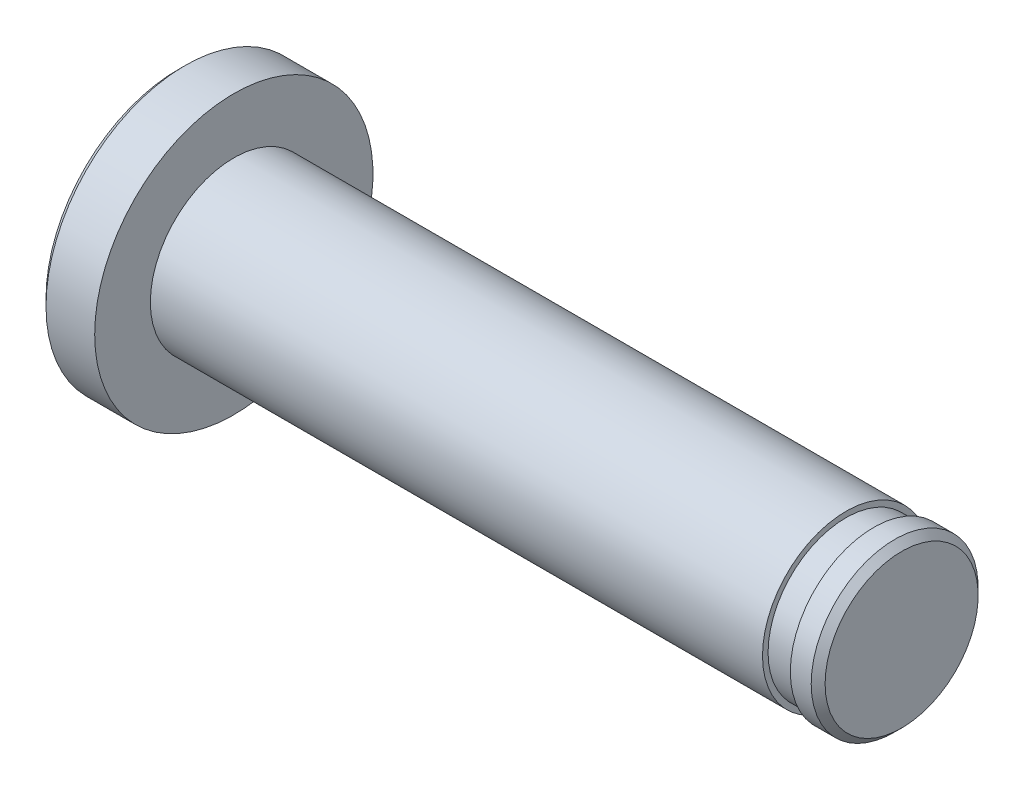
ISO-10303-21;
HEADER;
FILE_DESCRIPTION(('STEP AP214'),'2;1');
FILE_NAME('part.step','',(''),(''),'','','');
FILE_SCHEMA(('AUTOMOTIVE_DESIGN { 1 0 10303 214 1 1 1 1 }'));
ENDSEC;
DATA;
#1=APPLICATION_CONTEXT('core data for automotive mechanical design processes');
#2=APPLICATION_PROTOCOL_DEFINITION('international standard','automotive_design',2000,#1);
#3=PRODUCT_CONTEXT('',#1,'mechanical');
#4=PRODUCT('Part','Part','',(#3));
#5=PRODUCT_RELATED_PRODUCT_CATEGORY('part','',(#4));
#6=PRODUCT_DEFINITION_FORMATION('','',#4);
#7=PRODUCT_DEFINITION_CONTEXT('part definition',#1,'design');
#8=PRODUCT_DEFINITION('design','',#6,#7);
#9=PRODUCT_DEFINITION_SHAPE('','',#8);
#10=(LENGTH_UNIT() NAMED_UNIT(*) SI_UNIT(.MILLI.,.METRE.));
#11=(NAMED_UNIT(*) PLANE_ANGLE_UNIT() SI_UNIT($,.RADIAN.));
#12=(NAMED_UNIT(*) SI_UNIT($,.STERADIAN.) SOLID_ANGLE_UNIT());
#13=UNCERTAINTY_MEASURE_WITH_UNIT(LENGTH_MEASURE(1.E-05),#10,'distance_accuracy_value','');
#14=(GEOMETRIC_REPRESENTATION_CONTEXT(3) GLOBAL_UNCERTAINTY_ASSIGNED_CONTEXT((#13)) GLOBAL_UNIT_ASSIGNED_CONTEXT((#10,
#11,#12)) REPRESENTATION_CONTEXT('',''));
#15=CARTESIAN_POINT('',(0.,0.,0.));
#16=DIRECTION('',(0.,0.,1.));
#17=DIRECTION('',(1.,0.,0.));
#18=AXIS2_PLACEMENT_3D('',#15,#16,#17);
#19=CARTESIAN_POINT('',(24.,2.75,0.));
#20=DIRECTION('',(-1.,0.,0.));
#21=DIRECTION('',(0.,0.,1.));
#22=AXIS2_PLACEMENT_3D('',#19,#20,#21);
#23=PLANE('',#22);
#24=CARTESIAN_POINT('',(24.,0.,0.));
#25=DIRECTION('',(-1.,0.,0.));
#26=DIRECTION('',(0.,0.,1.));
#27=AXIS2_PLACEMENT_3D('',#24,#25,#26);
#28=CIRCLE('',#27,2.75);
#29=CARTESIAN_POINT('',(24.,0.,2.75));
#30=VERTEX_POINT('',#29);
#31=EDGE_CURVE('E10',#30,#30,#28,.T.);
#32=ORIENTED_EDGE('',*,*,#31,.F.);
#33=EDGE_LOOP('',(#32));
#34=FACE_BOUND('',#33,.T.);
#35=ADVANCED_FACE('F31',(#34),#23,.F.);
#36=CARTESIAN_POINT('',(24.,0.,0.));
#37=DIRECTION('',(-1.,0.,0.));
#38=DIRECTION('',(0.,0.,1.));
#39=AXIS2_PLACEMENT_3D('',#36,#37,#38);
#40=CONICAL_SURFACE('',#39,2.75,0.785398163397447);
#41=CARTESIAN_POINT('',(23.75,0.,0.));
#42=DIRECTION('',(-1.,0.,0.));
#43=DIRECTION('',(0.,0.,1.));
#44=AXIS2_PLACEMENT_3D('',#41,#42,#43);
#45=CIRCLE('',#44,3.);
#46=CARTESIAN_POINT('',(23.75,0.,3.));
#47=VERTEX_POINT('',#46);
#48=EDGE_CURVE('E37',#47,#47,#45,.T.);
#49=ORIENTED_EDGE('',*,*,#48,.F.);
#50=EDGE_LOOP('',(#49));
#51=FACE_BOUND('',#50,.T.);
#52=ORIENTED_EDGE('',*,*,#31,.T.);
#53=EDGE_LOOP('',(#52));
#54=FACE_BOUND('',#53,.T.);
#55=ADVANCED_FACE('F115',(#51,#54),#40,.T.);
#56=CARTESIAN_POINT('',(0.,0.,0.));
#57=DIRECTION('',(-1.,0.,0.));
#58=DIRECTION('',(0.,0.,1.));
#59=AXIS2_PLACEMENT_3D('',#56,#57,#58);
#60=CYLINDRICAL_SURFACE('',#59,3.);
#61=CARTESIAN_POINT('',(23.,0.,0.));
#62=DIRECTION('',(-1.,0.,0.));
#63=DIRECTION('',(0.,0.,1.));
#64=AXIS2_PLACEMENT_3D('',#61,#62,#63);
#65=CIRCLE('',#64,3.);
#66=CARTESIAN_POINT('',(23.,0.,3.));
#67=VERTEX_POINT('',#66);
#68=EDGE_CURVE('E41',#67,#67,#65,.T.);
#69=ORIENTED_EDGE('',*,*,#68,.F.);
#70=EDGE_LOOP('',(#69));
#71=FACE_BOUND('',#70,.T.);
#72=ORIENTED_EDGE('',*,*,#48,.T.);
#73=EDGE_LOOP('',(#72));
#74=FACE_BOUND('',#73,.T.);
#75=ADVANCED_FACE('F110',(#71,#74),#60,.T.);
#76=CARTESIAN_POINT('',(23.,2.8,0.));
#77=DIRECTION('',(1.,0.,0.));
#78=DIRECTION('',(0.,0.,-1.));
#79=AXIS2_PLACEMENT_3D('',#76,#77,#78);
#80=PLANE('',#79);
#81=CARTESIAN_POINT('',(23.,0.,0.));
#82=DIRECTION('',(-1.,0.,0.));
#83=DIRECTION('',(0.,0.,1.));
#84=AXIS2_PLACEMENT_3D('',#81,#82,#83);
#85=CIRCLE('',#84,2.8);
#86=CARTESIAN_POINT('',(23.,0.,2.8));
#87=VERTEX_POINT('',#86);
#88=EDGE_CURVE('E45',#87,#87,#85,.T.);
#89=ORIENTED_EDGE('',*,*,#88,.F.);
#90=EDGE_LOOP('',(#89));
#91=FACE_BOUND('',#90,.T.);
#92=ORIENTED_EDGE('',*,*,#68,.T.);
#93=EDGE_LOOP('',(#92));
#94=FACE_BOUND('',#93,.T.);
#95=ADVANCED_FACE('F104',(#91,#94),#80,.F.);
#96=CARTESIAN_POINT('',(0.,0.,0.));
#97=DIRECTION('',(-1.,0.,0.));
#98=DIRECTION('',(0.,0.,1.));
#99=AXIS2_PLACEMENT_3D('',#96,#97,#98);
#100=CYLINDRICAL_SURFACE('',#99,2.8);
#101=CARTESIAN_POINT('',(22.,0.,0.));
#102=DIRECTION('',(-1.,0.,0.));
#103=DIRECTION('',(0.,0.,1.));
#104=AXIS2_PLACEMENT_3D('',#101,#102,#103);
#105=CIRCLE('',#104,2.8);
#106=CARTESIAN_POINT('',(22.,0.,2.8));
#107=VERTEX_POINT('',#106);
#108=EDGE_CURVE('E50',#107,#107,#105,.T.);
#109=ORIENTED_EDGE('',*,*,#108,.F.);
#110=EDGE_LOOP('',(#109));
#111=FACE_BOUND('',#110,.T.);
#112=ORIENTED_EDGE('',*,*,#88,.T.);
#113=EDGE_LOOP('',(#112));
#114=FACE_BOUND('',#113,.T.);
#115=ADVANCED_FACE('F98',(#111,#114),#100,.T.);
#116=CARTESIAN_POINT('',(22.,3.,0.));
#117=DIRECTION('',(-1.,0.,0.));
#118=DIRECTION('',(0.,0.,1.));
#119=AXIS2_PLACEMENT_3D('',#116,#117,#118);
#120=PLANE('',#119);
#121=CARTESIAN_POINT('',(22.,0.,0.));
#122=DIRECTION('',(-1.,0.,0.));
#123=DIRECTION('',(0.,0.,1.));
#124=AXIS2_PLACEMENT_3D('',#121,#122,#123);
#125=CIRCLE('',#124,3.);
#126=CARTESIAN_POINT('',(22.,0.,3.));
#127=VERTEX_POINT('',#126);
#128=EDGE_CURVE('E53',#127,#127,#125,.T.);
#129=ORIENTED_EDGE('',*,*,#128,.F.);
#130=EDGE_LOOP('',(#129));
#131=FACE_BOUND('',#130,.T.);
#132=ORIENTED_EDGE('',*,*,#108,.T.);
#133=EDGE_LOOP('',(#132));
#134=FACE_BOUND('',#133,.T.);
#135=ADVANCED_FACE('F92',(#131,#134),#120,.F.);
#136=CARTESIAN_POINT('',(0.,0.,0.));
#137=DIRECTION('',(-1.,0.,0.));
#138=DIRECTION('',(0.,0.,1.));
#139=AXIS2_PLACEMENT_3D('',#136,#137,#138);
#140=CYLINDRICAL_SURFACE('',#139,3.);
#141=CARTESIAN_POINT('',(0.,0.,0.));
#142=DIRECTION('',(-1.,0.,0.));
#143=DIRECTION('',(0.,0.,1.));
#144=AXIS2_PLACEMENT_3D('',#141,#142,#143);
#145=CIRCLE('',#144,3.);
#146=CARTESIAN_POINT('',(0.,0.,3.));
#147=VERTEX_POINT('',#146);
#148=EDGE_CURVE('E56',#147,#147,#145,.T.);
#149=ORIENTED_EDGE('',*,*,#148,.F.);
#150=EDGE_LOOP('',(#149));
#151=FACE_BOUND('',#150,.T.);
#152=ORIENTED_EDGE('',*,*,#128,.T.);
#153=EDGE_LOOP('',(#152));
#154=FACE_BOUND('',#153,.T.);
#155=ADVANCED_FACE('F86',(#151,#154),#140,.T.);
#156=CARTESIAN_POINT('',(0.,5.,0.));
#157=DIRECTION('',(-1.,0.,0.));
#158=DIRECTION('',(0.,0.,1.));
#159=AXIS2_PLACEMENT_3D('',#156,#157,#158);
#160=PLANE('',#159);
#161=CARTESIAN_POINT('',(0.,0.,0.));
#162=DIRECTION('',(-1.,0.,0.));
#163=DIRECTION('',(0.,0.,1.));
#164=AXIS2_PLACEMENT_3D('',#161,#162,#163);
#165=CIRCLE('',#164,5.);
#166=CARTESIAN_POINT('',(0.,0.,5.));
#167=VERTEX_POINT('',#166);
#168=EDGE_CURVE('E59',#167,#167,#165,.T.);
#169=ORIENTED_EDGE('',*,*,#168,.F.);
#170=EDGE_LOOP('',(#169));
#171=FACE_BOUND('',#170,.T.);
#172=ORIENTED_EDGE('',*,*,#148,.T.);
#173=EDGE_LOOP('',(#172));
#174=FACE_BOUND('',#173,.T.);
#175=ADVANCED_FACE('F80',(#171,#174),#160,.F.);
#176=CARTESIAN_POINT('',(0.,0.,0.));
#177=DIRECTION('',(-1.,0.,0.));
#178=DIRECTION('',(0.,0.,1.));
#179=AXIS2_PLACEMENT_3D('',#176,#177,#178);
#180=CYLINDRICAL_SURFACE('',#179,5.);
#181=CARTESIAN_POINT('',(-1.75,0.,0.));
#182=DIRECTION('',(-1.,0.,0.));
#183=DIRECTION('',(0.,0.,1.));
#184=AXIS2_PLACEMENT_3D('',#181,#182,#183);
#185=CIRCLE('',#184,5.);
#186=CARTESIAN_POINT('',(-1.75,0.,5.));
#187=VERTEX_POINT('',#186);
#188=EDGE_CURVE('E62',#187,#187,#185,.T.);
#189=ORIENTED_EDGE('',*,*,#188,.F.);
#190=EDGE_LOOP('',(#189));
#191=FACE_BOUND('',#190,.T.);
#192=ORIENTED_EDGE('',*,*,#168,.T.);
#193=EDGE_LOOP('',(#192));
#194=FACE_BOUND('',#193,.T.);
#195=ADVANCED_FACE('F74',(#191,#194),#180,.T.);
#196=CARTESIAN_POINT('',(-1.75,0.,0.));
#197=DIRECTION('',(1.,0.,0.));
#198=DIRECTION('',(0.,0.,-1.));
#199=AXIS2_PLACEMENT_3D('',#196,#197,#198);
#200=CONICAL_SURFACE('',#199,5.,0.785398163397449);
#201=CARTESIAN_POINT('',(-2.,0.,0.));
#202=DIRECTION('',(-1.,0.,0.));
#203=DIRECTION('',(0.,0.,1.));
#204=AXIS2_PLACEMENT_3D('',#201,#202,#203);
#205=CIRCLE('',#204,4.75);
#206=CARTESIAN_POINT('',(-2.,0.,4.75));
#207=VERTEX_POINT('',#206);
#208=EDGE_CURVE('E65',#207,#207,#205,.T.);
#209=ORIENTED_EDGE('',*,*,#208,.F.);
#210=EDGE_LOOP('',(#209));
#211=FACE_BOUND('',#210,.T.);
#212=ORIENTED_EDGE('',*,*,#188,.T.);
#213=EDGE_LOOP('',(#212));
#214=FACE_BOUND('',#213,.T.);
#215=ADVANCED_FACE('F71',(#211,#214),#200,.T.);
#216=CARTESIAN_POINT('',(-2.,0.,0.));
#217=DIRECTION('',(1.,0.,0.));
#218=DIRECTION('',(0.,0.,-1.));
#219=AXIS2_PLACEMENT_3D('',#216,#217,#218);
#220=PLANE('',#219);
#221=ORIENTED_EDGE('',*,*,#208,.T.);
#222=EDGE_LOOP('',(#221));
#223=FACE_BOUND('',#222,.T.);
#224=ADVANCED_FACE('F69',(#223),#220,.F.);
#225=CLOSED_SHELL('',(#35,#55,#75,#95,#115,#135,#155,#175,#195,#215,#224));
#226=MANIFOLD_SOLID_BREP('B2',#225);
#227=ADVANCED_BREP_SHAPE_REPRESENTATION('',(#18,#226),#14);
#228=SHAPE_DEFINITION_REPRESENTATION(#9,#227);
ENDSEC;
END-ISO-10303-21;
